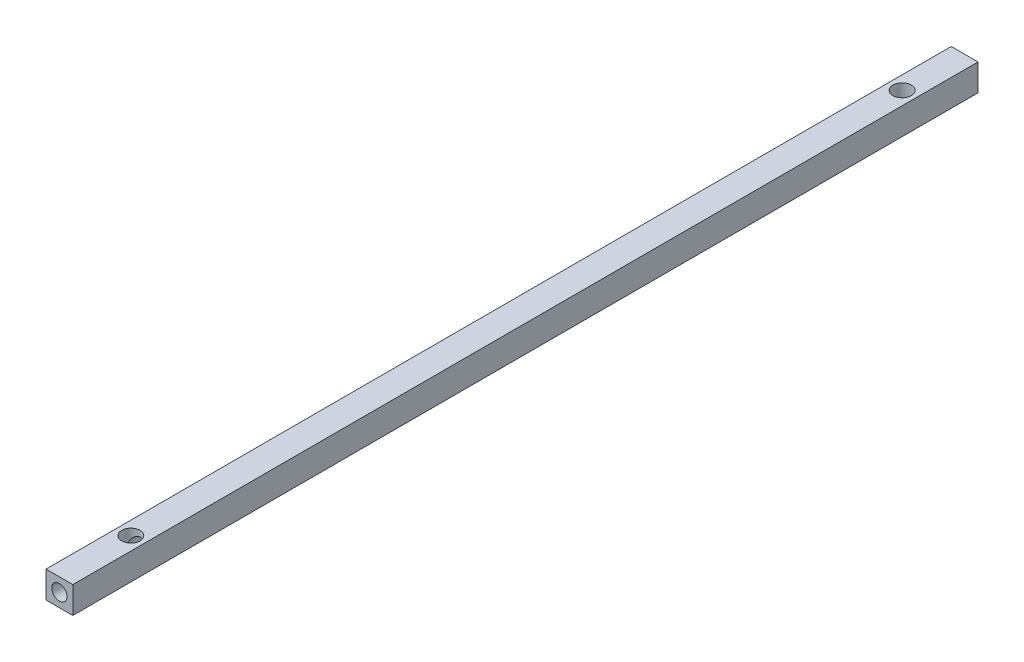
ISO-10303-21;
HEADER;
FILE_DESCRIPTION(('STEP AP214'),'2;1');
FILE_NAME('part.step','',(''),(''),'','','');
FILE_SCHEMA(('AUTOMOTIVE_DESIGN { 1 0 10303 214 1 1 1 1 }'));
ENDSEC;
DATA;
#1=APPLICATION_CONTEXT('core data for automotive mechanical design processes');
#2=APPLICATION_PROTOCOL_DEFINITION('international standard','automotive_design',2000,#1);
#3=PRODUCT_CONTEXT('',#1,'mechanical');
#4=PRODUCT('Part','Part','',(#3));
#5=PRODUCT_RELATED_PRODUCT_CATEGORY('part','',(#4));
#6=PRODUCT_DEFINITION_FORMATION('','',#4);
#7=PRODUCT_DEFINITION_CONTEXT('part definition',#1,'design');
#8=PRODUCT_DEFINITION('design','',#6,#7);
#9=PRODUCT_DEFINITION_SHAPE('','',#8);
#10=(LENGTH_UNIT() NAMED_UNIT(*) SI_UNIT(.MILLI.,.METRE.));
#11=(NAMED_UNIT(*) PLANE_ANGLE_UNIT() SI_UNIT($,.RADIAN.));
#12=(NAMED_UNIT(*) SI_UNIT($,.STERADIAN.) SOLID_ANGLE_UNIT());
#13=UNCERTAINTY_MEASURE_WITH_UNIT(LENGTH_MEASURE(1.E-05),#10,'distance_accuracy_value','');
#14=(GEOMETRIC_REPRESENTATION_CONTEXT(3) GLOBAL_UNCERTAINTY_ASSIGNED_CONTEXT((#13)) GLOBAL_UNIT_ASSIGNED_CONTEXT((#10,
#11,#12)) REPRESENTATION_CONTEXT('',''));
#15=CARTESIAN_POINT('',(0.,0.,0.));
#16=DIRECTION('',(0.,0.,1.));
#17=DIRECTION('',(1.,0.,0.));
#18=AXIS2_PLACEMENT_3D('',#15,#16,#17);
#19=CARTESIAN_POINT('',(0.,0.,160.9725));
#20=DIRECTION('',(1.,0.,0.));
#21=DIRECTION('',(0.,0.,-1.));
#22=AXIS2_PLACEMENT_3D('',#19,#20,#21);
#23=PLANE('',#22);
#24=DIRECTION('',(0.,-1.,0.));
#25=VECTOR('',#24,1.);
#26=CARTESIAN_POINT('',(0.,0.,0.));
#27=LINE('',#26,#25);
#28=CARTESIAN_POINT('',(0.,4.7625,0.));
#29=VERTEX_POINT('',#28);
#30=CARTESIAN_POINT('',(0.,0.,0.));
#31=VERTEX_POINT('',#30);
#32=EDGE_CURVE('E104',#29,#31,#27,.T.);
#33=ORIENTED_EDGE('',*,*,#32,.T.);
#34=DIRECTION('',(0.,0.,-1.));
#35=VECTOR('',#34,1.);
#36=CARTESIAN_POINT('',(0.,0.,160.9725));
#37=LINE('',#36,#35);
#38=CARTESIAN_POINT('',(0.,0.,160.9725));
#39=VERTEX_POINT('',#38);
#40=EDGE_CURVE('E11',#39,#31,#37,.T.);
#41=ORIENTED_EDGE('',*,*,#40,.F.);
#42=DIRECTION('',(0.,-1.,0.));
#43=VECTOR('',#42,1.);
#44=CARTESIAN_POINT('',(0.,0.,160.9725));
#45=LINE('',#44,#43);
#46=CARTESIAN_POINT('',(0.,4.7625,160.9725));
#47=VERTEX_POINT('',#46);
#48=EDGE_CURVE('E111',#47,#39,#45,.T.);
#49=ORIENTED_EDGE('',*,*,#48,.F.);
#50=DIRECTION('',(0.,0.,-1.));
#51=VECTOR('',#50,1.);
#52=CARTESIAN_POINT('',(0.,4.7625,160.9725));
#53=LINE('',#52,#51);
#54=EDGE_CURVE('E117',#47,#29,#53,.T.);
#55=ORIENTED_EDGE('',*,*,#54,.T.);
#56=EDGE_LOOP('',(#33,#41,#49,#55));
#57=FACE_BOUND('',#56,.T.);
#58=ADVANCED_FACE('F33',(#57),#23,.F.);
#59=CARTESIAN_POINT('',(0.,0.,160.9725));
#60=DIRECTION('',(0.,1.,0.));
#61=DIRECTION('',(0.,0.,1.));
#62=AXIS2_PLACEMENT_3D('',#59,#60,#61);
#63=PLANE('',#62);
#64=CARTESIAN_POINT('',(2.38125000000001,0.,148.2725));
#65=DIRECTION('',(0.,1.,0.));
#66=DIRECTION('',(0.,0.,1.));
#67=AXIS2_PLACEMENT_3D('',#64,#65,#66);
#68=CIRCLE('',#67,1.63195);
#69=CARTESIAN_POINT('',(2.38125000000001,0.,149.90445));
#70=VERTEX_POINT('',#69);
#71=EDGE_CURVE('E235',#70,#70,#68,.T.);
#72=ORIENTED_EDGE('',*,*,#71,.T.);
#73=EDGE_LOOP('',(#72));
#74=FACE_BOUND('',#73,.T.);
#75=CARTESIAN_POINT('',(2.38124999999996,0.,11.1125));
#76=DIRECTION('',(0.,1.,0.));
#77=DIRECTION('',(0.,0.,1.));
#78=AXIS2_PLACEMENT_3D('',#75,#76,#77);
#79=CIRCLE('',#78,1.63195);
#80=CARTESIAN_POINT('',(2.38124999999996,0.,12.74445));
#81=VERTEX_POINT('',#80);
#82=EDGE_CURVE('E101',#81,#81,#79,.T.);
#83=ORIENTED_EDGE('',*,*,#82,.T.);
#84=EDGE_LOOP('',(#83));
#85=FACE_BOUND('',#84,.T.);
#86=DIRECTION('',(1.,0.,0.));
#87=VECTOR('',#86,1.);
#88=CARTESIAN_POINT('',(0.,0.,0.));
#89=LINE('',#88,#87);
#90=CARTESIAN_POINT('',(4.7625,0.,0.));
#91=VERTEX_POINT('',#90);
#92=EDGE_CURVE('E120',#31,#91,#89,.T.);
#93=ORIENTED_EDGE('',*,*,#92,.T.);
#94=DIRECTION('',(0.,0.,-1.));
#95=VECTOR('',#94,1.);
#96=CARTESIAN_POINT('',(4.7625,0.,160.9725));
#97=LINE('',#96,#95);
#98=CARTESIAN_POINT('',(4.7625,0.,160.9725));
#99=VERTEX_POINT('',#98);
#100=EDGE_CURVE('E46',#99,#91,#97,.T.);
#101=ORIENTED_EDGE('',*,*,#100,.F.);
#102=DIRECTION('',(1.,0.,0.));
#103=VECTOR('',#102,1.);
#104=CARTESIAN_POINT('',(0.,0.,160.9725));
#105=LINE('',#104,#103);
#106=EDGE_CURVE('E86',#39,#99,#105,.T.);
#107=ORIENTED_EDGE('',*,*,#106,.F.);
#108=ORIENTED_EDGE('',*,*,#40,.T.);
#109=EDGE_LOOP('',(#93,#101,#107,#108));
#110=FACE_BOUND('',#109,.T.);
#111=ADVANCED_FACE('F151',(#74,#85,#110),#63,.F.);
#112=CARTESIAN_POINT('',(4.7625,0.,160.9725));
#113=DIRECTION('',(-1.,0.,0.));
#114=DIRECTION('',(0.,-1.,0.));
#115=AXIS2_PLACEMENT_3D('',#112,#113,#114);
#116=PLANE('',#115);
#117=DIRECTION('',(0.,1.,0.));
#118=VECTOR('',#117,1.);
#119=CARTESIAN_POINT('',(4.7625,0.,0.));
#120=LINE('',#119,#118);
#121=CARTESIAN_POINT('',(4.7625,4.7625,0.));
#122=VERTEX_POINT('',#121);
#123=EDGE_CURVE('E73',#91,#122,#120,.T.);
#124=ORIENTED_EDGE('',*,*,#123,.T.);
#125=DIRECTION('',(0.,0.,-1.));
#126=VECTOR('',#125,1.);
#127=CARTESIAN_POINT('',(4.7625,4.7625,160.9725));
#128=LINE('',#127,#126);
#129=CARTESIAN_POINT('',(4.7625,4.7625,160.9725));
#130=VERTEX_POINT('',#129);
#131=EDGE_CURVE('E125',#130,#122,#128,.T.);
#132=ORIENTED_EDGE('',*,*,#131,.F.);
#133=DIRECTION('',(0.,1.,0.));
#134=VECTOR('',#133,1.);
#135=CARTESIAN_POINT('',(4.7625,0.,160.9725));
#136=LINE('',#135,#134);
#137=EDGE_CURVE('E114',#99,#130,#136,.T.);
#138=ORIENTED_EDGE('',*,*,#137,.F.);
#139=ORIENTED_EDGE('',*,*,#100,.T.);
#140=EDGE_LOOP('',(#124,#132,#138,#139));
#141=FACE_BOUND('',#140,.T.);
#142=ADVANCED_FACE('F156',(#141),#116,.F.);
#143=CARTESIAN_POINT('',(0.,4.7625,160.9725));
#144=DIRECTION('',(0.,-1.,0.));
#145=DIRECTION('',(0.,0.,-1.));
#146=AXIS2_PLACEMENT_3D('',#143,#144,#145);
#147=PLANE('',#146);
#148=CARTESIAN_POINT('',(2.38125000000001,4.7625,148.2725));
#149=DIRECTION('',(0.,1.,0.));
#150=DIRECTION('',(0.,0.,1.));
#151=AXIS2_PLACEMENT_3D('',#148,#149,#150);
#152=CIRCLE('',#151,1.63195);
#153=CARTESIAN_POINT('',(2.38125000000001,4.7625,149.90445));
#154=VERTEX_POINT('',#153);
#155=EDGE_CURVE('E131',#154,#154,#152,.T.);
#156=ORIENTED_EDGE('',*,*,#155,.F.);
#157=EDGE_LOOP('',(#156));
#158=FACE_BOUND('',#157,.T.);
#159=CARTESIAN_POINT('',(2.38124999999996,4.7625,11.1125));
#160=DIRECTION('',(0.,1.,0.));
#161=DIRECTION('',(0.,0.,1.));
#162=AXIS2_PLACEMENT_3D('',#159,#160,#161);
#163=CIRCLE('',#162,1.63195);
#164=CARTESIAN_POINT('',(2.38124999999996,4.7625,12.74445));
#165=VERTEX_POINT('',#164);
#166=EDGE_CURVE('E107',#165,#165,#163,.T.);
#167=ORIENTED_EDGE('',*,*,#166,.F.);
#168=EDGE_LOOP('',(#167));
#169=FACE_BOUND('',#168,.T.);
#170=DIRECTION('',(-1.,0.,0.));
#171=VECTOR('',#170,1.);
#172=CARTESIAN_POINT('',(0.,4.7625,0.));
#173=LINE('',#172,#171);
#174=EDGE_CURVE('E79',#122,#29,#173,.T.);
#175=ORIENTED_EDGE('',*,*,#174,.T.);
#176=ORIENTED_EDGE('',*,*,#54,.F.);
#177=DIRECTION('',(-1.,0.,0.));
#178=VECTOR('',#177,1.);
#179=CARTESIAN_POINT('',(0.,4.7625,160.9725));
#180=LINE('',#179,#178);
#181=EDGE_CURVE('E55',#130,#47,#180,.T.);
#182=ORIENTED_EDGE('',*,*,#181,.F.);
#183=ORIENTED_EDGE('',*,*,#131,.T.);
#184=EDGE_LOOP('',(#175,#176,#182,#183));
#185=FACE_BOUND('',#184,.T.);
#186=ADVANCED_FACE('F165',(#158,#169,#185),#147,.F.);
#187=CARTESIAN_POINT('',(0.,4.7625,160.9725));
#188=DIRECTION('',(0.,0.,-1.));
#189=DIRECTION('',(-1.,0.,0.));
#190=AXIS2_PLACEMENT_3D('',#187,#188,#189);
#191=PLANE('',#190);
#192=CARTESIAN_POINT('',(2.38125,2.38125,160.9725));
#193=DIRECTION('',(0.,0.,1.));
#194=DIRECTION('',(1.,0.,0.));
#195=AXIS2_PLACEMENT_3D('',#192,#193,#194);
#196=CIRCLE('',#195,1.35255);
#197=CARTESIAN_POINT('',(3.7338,2.38125,160.9725));
#198=VERTEX_POINT('',#197);
#199=EDGE_CURVE('E100',#198,#198,#196,.T.);
#200=ORIENTED_EDGE('',*,*,#199,.F.);
#201=EDGE_LOOP('',(#200));
#202=FACE_BOUND('',#201,.T.);
#203=ORIENTED_EDGE('',*,*,#48,.T.);
#204=ORIENTED_EDGE('',*,*,#106,.T.);
#205=ORIENTED_EDGE('',*,*,#137,.T.);
#206=ORIENTED_EDGE('',*,*,#181,.T.);
#207=EDGE_LOOP('',(#203,#204,#205,#206));
#208=FACE_BOUND('',#207,.T.);
#209=ADVANCED_FACE('F163',(#202,#208),#191,.F.);
#210=CARTESIAN_POINT('',(0.,4.7625,0.));
#211=DIRECTION('',(0.,0.,-1.));
#212=DIRECTION('',(-1.,0.,0.));
#213=AXIS2_PLACEMENT_3D('',#210,#211,#212);
#214=PLANE('',#213);
#215=ORIENTED_EDGE('',*,*,#32,.F.);
#216=ORIENTED_EDGE('',*,*,#174,.F.);
#217=ORIENTED_EDGE('',*,*,#123,.F.);
#218=ORIENTED_EDGE('',*,*,#92,.F.);
#219=EDGE_LOOP('',(#215,#216,#217,#218));
#220=FACE_BOUND('',#219,.T.);
#221=ADVANCED_FACE('F146',(#220),#214,.T.);
#222=CARTESIAN_POINT('',(2.38125,2.38125,160.9725));
#223=DIRECTION('',(0.,0.,1.));
#224=DIRECTION('',(1.,0.,0.));
#225=AXIS2_PLACEMENT_3D('',#222,#223,#224);
#226=CYLINDRICAL_SURFACE('',#225,1.35255);
#227=CARTESIAN_POINT('',(3.7338,2.38125,149.185664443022));
#228=CARTESIAN_POINT('',(3.73379618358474,2.33303703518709,149.185674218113));
#229=CARTESIAN_POINT('',(3.73119037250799,2.28474868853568,149.189565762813));
#230=CARTESIAN_POINT('',(3.72103475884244,2.18974984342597,149.204331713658));
#231=CARTESIAN_POINT('',(3.71346907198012,2.14304492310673,149.215228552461));
#232=CARTESIAN_POINT('',(3.69024796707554,2.03477007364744,149.247335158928));
#233=CARTESIAN_POINT('',(3.672605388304,1.97434519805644,149.270895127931));
#234=CARTESIAN_POINT('',(3.63023795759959,1.85851949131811,149.323421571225));
#235=CARTESIAN_POINT('',(3.60549008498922,1.80313577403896,149.35240551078));
#236=CARTESIAN_POINT('',(3.5374430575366,1.67414764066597,149.425729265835));
#237=CARTESIAN_POINT('',(3.49074952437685,1.60302063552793,149.471289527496));
#238=CARTESIAN_POINT('',(3.38466704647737,1.47035248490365,149.5614055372));
#239=CARTESIAN_POINT('',(3.32529005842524,1.40880240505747,149.605962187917));
#240=CARTESIAN_POINT('',(3.20768355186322,1.30838033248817,149.68106849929));
#241=CARTESIAN_POINT('',(3.1518339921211,1.26746062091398,149.712594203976));
#242=CARTESIAN_POINT('',(3.03253418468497,1.19376648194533,149.770319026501));
#243=CARTESIAN_POINT('',(2.96909640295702,1.16097896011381,149.796526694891));
#244=CARTESIAN_POINT('',(2.84701948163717,1.11001282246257,149.83766115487));
#245=CARTESIAN_POINT('',(2.78941988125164,1.09029379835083,149.853751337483));
#246=CARTESIAN_POINT('',(2.67076476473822,1.05862586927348,149.879709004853));
#247=CARTESIAN_POINT('',(2.60971123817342,1.04667253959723,149.889580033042));
#248=CARTESIAN_POINT('',(2.48554537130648,1.03127179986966,149.902313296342));
#249=CARTESIAN_POINT('',(2.42242567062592,1.02785916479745,149.90514687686));
#250=CARTESIAN_POINT('',(2.29642983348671,1.02989294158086,149.903461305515));
#251=CARTESIAN_POINT('',(2.23355368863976,1.0353390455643,149.898942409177));
#252=CARTESIAN_POINT('',(2.11410982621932,1.05405554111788,149.883490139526));
#253=CARTESIAN_POINT('',(2.05739839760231,1.0667912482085,149.87299534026));
#254=CARTESIAN_POINT('',(1.94721601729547,1.09894625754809,149.846694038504));
#255=CARTESIAN_POINT('',(1.89374593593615,1.11836734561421,149.830886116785));
#256=CARTESIAN_POINT('',(1.7864048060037,1.16499763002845,149.793332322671));
#257=CARTESIAN_POINT('',(1.73290710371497,1.19273912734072,149.771188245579));
#258=CARTESIAN_POINT('',(1.63131966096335,1.25407566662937,149.723027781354));
#259=CARTESIAN_POINT('',(1.58323212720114,1.28767308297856,149.697009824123));
#260=CARTESIAN_POINT('',(1.48326609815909,1.3673901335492,149.63667100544));
#261=CARTESIAN_POINT('',(1.43267263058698,1.41466144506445,149.60174770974));
#262=CARTESIAN_POINT('',(1.33967254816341,1.51566775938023,149.530205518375));
#263=CARTESIAN_POINT('',(1.29727928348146,1.56941307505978,149.493583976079));
#264=CARTESIAN_POINT('',(1.22080074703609,1.68307201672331,149.421146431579));
#265=CARTESIAN_POINT('',(1.1867205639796,1.74298938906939,149.385330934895));
#266=CARTESIAN_POINT('',(1.1273924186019,1.86930755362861,149.318012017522));
#267=CARTESIAN_POINT('',(1.10212488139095,1.93569355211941,149.286499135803));
#268=CARTESIAN_POINT('',(1.06943532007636,2.04875214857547,149.243500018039));
#269=CARTESIAN_POINT('',(1.0588806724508,2.09332881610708,149.228954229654));
#270=CARTESIAN_POINT('',(1.04225377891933,2.18471327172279,149.205536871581));
#271=CARTESIAN_POINT('',(1.03616994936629,2.2315149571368,149.196650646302));
#272=CARTESIAN_POINT('',(1.02894697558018,2.32680225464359,149.186056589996));
#273=CARTESIAN_POINT('',(1.02785456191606,2.37529951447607,149.184416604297));
#274=CARTESIAN_POINT('',(1.03086826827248,2.47178793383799,149.188870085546));
#275=CARTESIAN_POINT('',(1.03497924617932,2.51977857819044,149.194970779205));
#276=CARTESIAN_POINT('',(1.04912533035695,2.62197750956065,149.215302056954));
#277=CARTESIAN_POINT('',(1.06007277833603,2.67580058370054,149.230770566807));
#278=CARTESIAN_POINT('',(1.08764390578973,2.77986196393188,149.267675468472));
#279=CARTESIAN_POINT('',(1.10428608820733,2.83008793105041,149.289131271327));
#280=CARTESIAN_POINT('',(1.15351642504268,2.95464296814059,149.348669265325));
#281=CARTESIAN_POINT('',(1.18977945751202,3.02631336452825,149.389238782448));
#282=CARTESIAN_POINT('',(1.27354283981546,3.16144025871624,149.472402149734));
#283=CARTESIAN_POINT('',(1.32106102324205,3.22488347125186,149.514999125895));
#284=CARTESIAN_POINT('',(1.42905948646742,3.3453505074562,149.599704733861));
#285=CARTESIAN_POINT('',(1.4899338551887,3.40207348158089,149.641744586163));
#286=CARTESIAN_POINT('',(1.62340680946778,3.50468389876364,149.719869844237));
#287=CARTESIAN_POINT('',(1.69597090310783,3.55060227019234,149.755972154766));
#288=CARTESIAN_POINT('',(1.82825123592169,3.61708514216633,149.809019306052));
#289=CARTESIAN_POINT('',(1.88522707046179,3.64111839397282,149.82845682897));
#290=CARTESIAN_POINT('',(2.00350511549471,3.68147844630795,149.861312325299));
#291=CARTESIAN_POINT('',(2.06480403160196,3.69781104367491,149.874734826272));
#292=CARTESIAN_POINT('',(2.1905884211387,3.72183179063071,149.89453024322));
#293=CARTESIAN_POINT('',(2.25509024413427,3.72946950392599,149.90086202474));
#294=CARTESIAN_POINT('',(2.38481495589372,3.73535107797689,149.905734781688));
#295=CARTESIAN_POINT('',(2.45003765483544,3.73359735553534,149.904277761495));
#296=CARTESIAN_POINT('',(2.57309839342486,3.72142327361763,149.894204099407));
#297=CARTESIAN_POINT('',(2.63107305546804,3.71179648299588,149.886243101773));
#298=CARTESIAN_POINT('',(2.74426216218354,3.68547087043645,149.864607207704));
#299=CARTESIAN_POINT('',(2.79947619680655,3.66877100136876,149.850931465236));
#300=CARTESIAN_POINT('',(2.90883857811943,3.62809466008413,149.817926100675));
#301=CARTESIAN_POINT('',(2.96278494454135,3.60378719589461,149.798341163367));
#302=CARTESIAN_POINT('',(3.06576667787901,3.54925234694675,149.755006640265));
#303=CARTESIAN_POINT('',(3.1147989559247,3.51902127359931,149.731254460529));
#304=CARTESIAN_POINT('',(3.2293461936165,3.43817066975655,149.668924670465));
#305=CARTESIAN_POINT('',(3.29185631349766,3.38462516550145,149.628605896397));
#306=CARTESIAN_POINT('',(3.40548644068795,3.2683640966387,149.544972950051));
#307=CARTESIAN_POINT('',(3.45657769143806,3.20562602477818,149.501651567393));
#308=CARTESIAN_POINT('',(3.54064276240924,3.08125050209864,149.422244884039));
#309=CARTESIAN_POINT('',(3.57516394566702,3.02074505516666,149.386012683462));
#310=CARTESIAN_POINT('',(3.63516986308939,2.89313487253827,149.31795766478));
#311=CARTESIAN_POINT('',(3.6606801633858,2.82604950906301,149.286122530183));
#312=CARTESIAN_POINT('',(3.69378066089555,2.71107908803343,149.242541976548));
#313=CARTESIAN_POINT('',(3.70450859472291,2.66528466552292,149.227722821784));
#314=CARTESIAN_POINT('',(3.72120991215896,2.57138127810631,149.204155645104));
#315=CARTESIAN_POINT('',(3.72720173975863,2.52328207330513,149.195384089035));
#316=CARTESIAN_POINT('',(3.73164358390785,2.4591737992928,149.188851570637));
#317=CARTESIAN_POINT('',(3.73245061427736,2.44362776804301,149.187660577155));
#318=CARTESIAN_POINT('',(3.73352950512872,2.41247380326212,149.186065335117));
#319=CARTESIAN_POINT('',(3.73380123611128,2.39686585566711,149.185661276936));
#320=CARTESIAN_POINT('',(3.7338,2.38125,149.185664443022));
#321=B_SPLINE_CURVE_WITH_KNOTS('',3,(#227,#228,#229,#230,#231,#232,#233,#234,#235,#236,#237,
#238,#239,#240,#241,#242,#243,#244,#245,#246,#247,#248,#249,#250,#251,#252,#253,#254,#255,#256,
#257,#258,#259,#260,#261,#262,#263,#264,#265,#266,#267,#268,#269,#270,#271,#272,#273,#274,#275,
#276,#277,#278,#279,#280,#281,#282,#283,#284,#285,#286,#287,#288,#289,#290,#291,#292,#293,#294,
#295,#296,#297,#298,#299,#300,#301,#302,#303,#304,#305,#306,#307,#308,#309,#310,#311,#312,#313,
#314,#315,#316,#317,#318,#319,#320),.UNSPECIFIED.,.T.,.F.,(4,2,2,2,2,2,2,2,2,2,2,2,2,2,2,2,2,2,
2,2,2,2,2,2,2,2,2,2,2,2,2,2,2,2,2,2,2,2,2,2,2,2,2,2,2,2,4),(0.,0.144569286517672,
0.289603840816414,0.490098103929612,0.691249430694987,0.979385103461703,1.26725034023,
1.49463481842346,1.72165075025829,1.90977820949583,2.09779838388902,2.28658287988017,
2.47536081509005,2.65179970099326,2.82828575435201,3.02019561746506,3.21218347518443,
3.44402286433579,3.67623657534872,3.90859207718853,4.14042812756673,4.28415980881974,
4.42751776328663,4.57221514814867,4.7170477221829,4.8872750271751,5.05806075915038,
5.32659997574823,5.59556756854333,5.8739106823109,6.15144706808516,6.3451466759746,
6.53870023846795,6.73337091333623,6.92799149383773,7.1051099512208,7.28225463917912,
7.46853947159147,7.65494067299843,7.92844749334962,8.20263552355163,8.4375096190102,
8.67171186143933,8.81917654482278,8.96606408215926,9.01287777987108,9.05970280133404),.UNSPECIFIED.);
#322=CARTESIAN_POINT('',(3.7338,2.38125,149.185664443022));
#323=VERTEX_POINT('',#322);
#324=EDGE_CURVE('E127',#323,#323,#321,.T.);
#325=ORIENTED_EDGE('',*,*,#324,.T.);
#326=EDGE_LOOP('',(#325));
#327=FACE_BOUND('',#326,.T.);
#328=ORIENTED_EDGE('',*,*,#199,.T.);
#329=EDGE_LOOP('',(#328));
#330=FACE_BOUND('',#329,.T.);
#331=ADVANCED_FACE('F132',(#327,#330),#226,.F.);
#332=CARTESIAN_POINT('',(2.38124999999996,4.7625,11.1125));
#333=DIRECTION('',(0.,1.,0.));
#334=DIRECTION('',(0.,0.,1.));
#335=AXIS2_PLACEMENT_3D('',#332,#333,#334);
#336=CYLINDRICAL_SURFACE('',#335,1.63195);
#337=ORIENTED_EDGE('',*,*,#166,.T.);
#338=EDGE_LOOP('',(#337));
#339=FACE_BOUND('',#338,.T.);
#340=ORIENTED_EDGE('',*,*,#82,.F.);
#341=EDGE_LOOP('',(#340));
#342=FACE_BOUND('',#341,.T.);
#343=ADVANCED_FACE('F138',(#339,#342),#336,.F.);
#344=CARTESIAN_POINT('',(2.38125000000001,4.7625,148.2725));
#345=DIRECTION('',(0.,1.,0.));
#346=DIRECTION('',(0.,0.,1.));
#347=AXIS2_PLACEMENT_3D('',#344,#345,#346);
#348=CYLINDRICAL_SURFACE('',#347,1.63195);
#349=CARTESIAN_POINT('',(3.7338,2.38125,147.359335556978));
#350=CARTESIAN_POINT('',(3.73379618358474,2.42946296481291,147.359325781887));
#351=CARTESIAN_POINT('',(3.73119037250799,2.47775131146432,147.355434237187));
#352=CARTESIAN_POINT('',(3.72103475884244,2.57275015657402,147.340668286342));
#353=CARTESIAN_POINT('',(3.71346907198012,2.61945507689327,147.329771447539));
#354=CARTESIAN_POINT('',(3.69024796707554,2.72772992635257,147.297664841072));
#355=CARTESIAN_POINT('',(3.672605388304,2.78815480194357,147.274104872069));
#356=CARTESIAN_POINT('',(3.63023795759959,2.9039805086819,147.221578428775));
#357=CARTESIAN_POINT('',(3.60549008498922,2.95936422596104,147.19259448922));
#358=CARTESIAN_POINT('',(3.5374430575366,3.08835235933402,147.119270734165));
#359=CARTESIAN_POINT('',(3.49074952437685,3.15947936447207,147.073710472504));
#360=CARTESIAN_POINT('',(3.38466704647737,3.29214751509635,146.9835944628));
#361=CARTESIAN_POINT('',(3.32529005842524,3.35369759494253,146.939037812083));
#362=CARTESIAN_POINT('',(3.20768355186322,3.45411966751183,146.86393150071));
#363=CARTESIAN_POINT('',(3.1518339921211,3.49503937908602,146.832405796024));
#364=CARTESIAN_POINT('',(3.03253418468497,3.56873351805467,146.774680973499));
#365=CARTESIAN_POINT('',(2.96909640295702,3.60152103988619,146.748473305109));
#366=CARTESIAN_POINT('',(2.84701948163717,3.65248717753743,146.70733884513));
#367=CARTESIAN_POINT('',(2.78941988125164,3.67220620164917,146.691248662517));
#368=CARTESIAN_POINT('',(2.67076476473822,3.70387413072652,146.665290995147));
#369=CARTESIAN_POINT('',(2.60971123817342,3.71582746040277,146.655419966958));
#370=CARTESIAN_POINT('',(2.48554537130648,3.73122820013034,146.642686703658));
#371=CARTESIAN_POINT('',(2.42242567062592,3.73464083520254,146.63985312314));
#372=CARTESIAN_POINT('',(2.29642983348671,3.73260705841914,146.641538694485));
#373=CARTESIAN_POINT('',(2.23355368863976,3.72716095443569,146.646057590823));
#374=CARTESIAN_POINT('',(2.11410982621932,3.70844445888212,146.661509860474));
#375=CARTESIAN_POINT('',(2.05739839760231,3.6957087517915,146.67200465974));
#376=CARTESIAN_POINT('',(1.94721601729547,3.66355374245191,146.698305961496));
#377=CARTESIAN_POINT('',(1.89374593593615,3.64413265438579,146.714113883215));
#378=CARTESIAN_POINT('',(1.7864048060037,3.59750236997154,146.751667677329));
#379=CARTESIAN_POINT('',(1.73290710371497,3.56976087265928,146.773811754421));
#380=CARTESIAN_POINT('',(1.63131966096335,3.50842433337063,146.821972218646));
#381=CARTESIAN_POINT('',(1.58323212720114,3.47482691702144,146.847990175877));
#382=CARTESIAN_POINT('',(1.48326609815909,3.3951098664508,146.90832899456));
#383=CARTESIAN_POINT('',(1.43267263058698,3.34783855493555,146.94325229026));
#384=CARTESIAN_POINT('',(1.33967254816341,3.24683224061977,147.014794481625));
#385=CARTESIAN_POINT('',(1.29727928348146,3.19308692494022,147.051416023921));
#386=CARTESIAN_POINT('',(1.22080074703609,3.07942798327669,147.123853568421));
#387=CARTESIAN_POINT('',(1.1867205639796,3.01951061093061,147.159669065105));
#388=CARTESIAN_POINT('',(1.12739241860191,2.89319244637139,147.226987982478));
#389=CARTESIAN_POINT('',(1.10212488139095,2.82680644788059,147.258500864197));
#390=CARTESIAN_POINT('',(1.06943532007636,2.71374785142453,147.301499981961));
#391=CARTESIAN_POINT('',(1.0588806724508,2.66917118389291,147.316045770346));
#392=CARTESIAN_POINT('',(1.04225377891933,2.57778672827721,147.339463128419));
#393=CARTESIAN_POINT('',(1.03616994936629,2.53098504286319,147.348349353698));
#394=CARTESIAN_POINT('',(1.02894697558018,2.43569774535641,147.358943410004));
#395=CARTESIAN_POINT('',(1.02785456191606,2.38720048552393,147.360583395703));
#396=CARTESIAN_POINT('',(1.03086826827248,2.29071206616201,147.356129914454));
#397=CARTESIAN_POINT('',(1.03497924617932,2.24272142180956,147.350029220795));
#398=CARTESIAN_POINT('',(1.04912533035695,2.14052249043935,147.329697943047));
#399=CARTESIAN_POINT('',(1.06007277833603,2.08669941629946,147.314229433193));
#400=CARTESIAN_POINT('',(1.08764390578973,1.98263803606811,147.277324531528));
#401=CARTESIAN_POINT('',(1.10428608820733,1.93241206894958,147.255868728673));
#402=CARTESIAN_POINT('',(1.15351642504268,1.80785703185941,147.196330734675));
#403=CARTESIAN_POINT('',(1.18977945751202,1.73618663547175,147.155761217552));
#404=CARTESIAN_POINT('',(1.27354283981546,1.60105974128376,147.072597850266));
#405=CARTESIAN_POINT('',(1.32106102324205,1.53761652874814,147.030000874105));
#406=CARTESIAN_POINT('',(1.42905948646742,1.41714949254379,146.945295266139));
#407=CARTESIAN_POINT('',(1.4899338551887,1.36042651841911,146.903255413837));
#408=CARTESIAN_POINT('',(1.62340680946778,1.25781610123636,146.825130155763));
#409=CARTESIAN_POINT('',(1.69597090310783,1.21189772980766,146.789027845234));
#410=CARTESIAN_POINT('',(1.82825123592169,1.14541485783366,146.735980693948));
#411=CARTESIAN_POINT('',(1.88522707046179,1.12138160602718,146.71654317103));
#412=CARTESIAN_POINT('',(2.00350511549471,1.08102155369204,146.683687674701));
#413=CARTESIAN_POINT('',(2.06480403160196,1.06468895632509,146.670265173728));
#414=CARTESIAN_POINT('',(2.1905884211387,1.04066820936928,146.65046975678));
#415=CARTESIAN_POINT('',(2.25509024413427,1.03303049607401,146.64413797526));
#416=CARTESIAN_POINT('',(2.38481495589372,1.02714892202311,146.639265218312));
#417=CARTESIAN_POINT('',(2.45003765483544,1.02890264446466,146.640722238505));
#418=CARTESIAN_POINT('',(2.57309839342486,1.04107672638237,146.650795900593));
#419=CARTESIAN_POINT('',(2.63107305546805,1.05070351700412,146.658756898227));
#420=CARTESIAN_POINT('',(2.74426216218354,1.07702912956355,146.680392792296));
#421=CARTESIAN_POINT('',(2.79947619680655,1.09372899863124,146.694068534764));
#422=CARTESIAN_POINT('',(2.90883857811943,1.13440533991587,146.727073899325));
#423=CARTESIAN_POINT('',(2.96278494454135,1.15871280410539,146.746658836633));
#424=CARTESIAN_POINT('',(3.06576667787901,1.21324765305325,146.789993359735));
#425=CARTESIAN_POINT('',(3.1147989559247,1.24347872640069,146.813745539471));
#426=CARTESIAN_POINT('',(3.22934619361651,1.32432933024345,146.876075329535));
#427=CARTESIAN_POINT('',(3.29185631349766,1.37787483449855,146.916394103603));
#428=CARTESIAN_POINT('',(3.40548644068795,1.4941359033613,147.000027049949));
#429=CARTESIAN_POINT('',(3.45657769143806,1.55687397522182,147.043348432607));
#430=CARTESIAN_POINT('',(3.54064276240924,1.68124949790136,147.122755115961));
#431=CARTESIAN_POINT('',(3.57516394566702,1.74175494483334,147.158987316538));
#432=CARTESIAN_POINT('',(3.63516986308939,1.86936512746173,147.22704233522));
#433=CARTESIAN_POINT('',(3.6606801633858,1.93645049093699,147.258877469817));
#434=CARTESIAN_POINT('',(3.69378066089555,2.05142091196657,147.302458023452));
#435=CARTESIAN_POINT('',(3.70450859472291,2.09721533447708,147.317277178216));
#436=CARTESIAN_POINT('',(3.72120991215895,2.19111872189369,147.340844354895));
#437=CARTESIAN_POINT('',(3.72720173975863,2.23921792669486,147.349615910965));
#438=CARTESIAN_POINT('',(3.73164358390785,2.3033262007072,147.356148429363));
#439=CARTESIAN_POINT('',(3.73245061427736,2.31887223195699,147.357339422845));
#440=CARTESIAN_POINT('',(3.73352950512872,2.35002619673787,147.358934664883));
#441=CARTESIAN_POINT('',(3.73380123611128,2.36563414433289,147.359338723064));
#442=CARTESIAN_POINT('',(3.7338,2.38125,147.359335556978));
#443=B_SPLINE_CURVE_WITH_KNOTS('',3,(#349,#350,#351,#352,#353,#354,#355,#356,#357,#358,#359,
#360,#361,#362,#363,#364,#365,#366,#367,#368,#369,#370,#371,#372,#373,#374,#375,#376,#377,#378,
#379,#380,#381,#382,#383,#384,#385,#386,#387,#388,#389,#390,#391,#392,#393,#394,#395,#396,#397,
#398,#399,#400,#401,#402,#403,#404,#405,#406,#407,#408,#409,#410,#411,#412,#413,#414,#415,#416,
#417,#418,#419,#420,#421,#422,#423,#424,#425,#426,#427,#428,#429,#430,#431,#432,#433,#434,#435,
#436,#437,#438,#439,#440,#441,#442),.UNSPECIFIED.,.T.,.F.,(4,2,2,2,2,2,2,2,2,2,2,2,2,2,2,2,2,2,
2,2,2,2,2,2,2,2,2,2,2,2,2,2,2,2,2,2,2,2,2,2,2,2,2,2,2,2,4),(0.,0.144569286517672,
0.289603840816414,0.490098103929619,0.691249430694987,0.979385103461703,1.26725034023,
1.49463481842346,1.72165075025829,1.90977820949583,2.09779838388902,2.28658287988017,
2.47536081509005,2.65179970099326,2.82828575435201,3.02019561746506,3.21218347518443,
3.44402286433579,3.67623657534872,3.90859207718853,4.14042812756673,4.28415980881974,
4.42751776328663,4.57221514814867,4.7170477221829,4.8872750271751,5.05806075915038,
5.32659997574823,5.59556756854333,5.8739106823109,6.15144706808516,6.3451466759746,
6.53870023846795,6.73337091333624,6.92799149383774,7.1051099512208,7.28225463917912,
7.46853947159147,7.65494067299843,7.92844749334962,8.20263552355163,8.4375096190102,
8.67171186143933,8.81917654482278,8.96606408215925,9.01287777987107,9.05970280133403),.UNSPECIFIED.);
#444=CARTESIAN_POINT('',(3.7338,2.38125,147.359335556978));
#445=VERTEX_POINT('',#444);
#446=EDGE_CURVE('E36',#445,#445,#443,.T.);
#447=ORIENTED_EDGE('',*,*,#446,.F.);
#448=EDGE_LOOP('',(#447));
#449=FACE_BOUND('',#448,.T.);
#450=ORIENTED_EDGE('',*,*,#155,.T.);
#451=EDGE_LOOP('',(#450));
#452=FACE_BOUND('',#451,.T.);
#453=ORIENTED_EDGE('',*,*,#324,.F.);
#454=EDGE_LOOP('',(#453));
#455=FACE_BOUND('',#454,.T.);
#456=ORIENTED_EDGE('',*,*,#71,.F.);
#457=EDGE_LOOP('',(#456));
#458=FACE_BOUND('',#457,.T.);
#459=ADVANCED_FACE('F94',(#449,#452,#455,#458),#348,.F.);
#460=CARTESIAN_POINT('',(2.38125,2.38125,144.2085));
#461=DIRECTION('',(0.,0.,1.));
#462=DIRECTION('',(1.,0.,0.));
#463=AXIS2_PLACEMENT_3D('',#460,#461,#462);
#464=CONICAL_SURFACE('',#463,1.35255,1.02974425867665);
#465=CARTESIAN_POINT('',(2.38125,2.38125,143.395805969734));
#466=VERTEX_POINT('',#465);
#467=VERTEX_LOOP('',#466);
#468=FACE_BOUND('',#467,.T.);
#469=CARTESIAN_POINT('',(2.38125,2.38125,144.2085));
#470=DIRECTION('',(0.,0.,1.));
#471=DIRECTION('',(1.,0.,0.));
#472=AXIS2_PLACEMENT_3D('',#469,#470,#471);
#473=CIRCLE('',#472,1.35255);
#474=CARTESIAN_POINT('',(3.7338,2.38125,144.2085));
#475=VERTEX_POINT('',#474);
#476=EDGE_CURVE('E98',#475,#475,#473,.T.);
#477=ORIENTED_EDGE('',*,*,#476,.T.);
#478=EDGE_LOOP('',(#477));
#479=FACE_BOUND('',#478,.T.);
#480=ADVANCED_FACE('F90',(#468,#479),#464,.F.);
#481=ORIENTED_EDGE('',*,*,#446,.T.);
#482=EDGE_LOOP('',(#481));
#483=FACE_BOUND('',#482,.T.);
#484=ORIENTED_EDGE('',*,*,#476,.F.);
#485=EDGE_LOOP('',(#484));
#486=FACE_BOUND('',#485,.T.);
#487=ADVANCED_FACE('F93',(#483,#486),#226,.F.);
#488=CLOSED_SHELL('',(#58,#111,#142,#186,#209,#221,#331,#343,#459,#480,#487));
#489=MANIFOLD_SOLID_BREP('B2',#488);
#490=ADVANCED_BREP_SHAPE_REPRESENTATION('',(#18,#489),#14);
#491=SHAPE_DEFINITION_REPRESENTATION(#9,#490);
ENDSEC;
END-ISO-10303-21;
